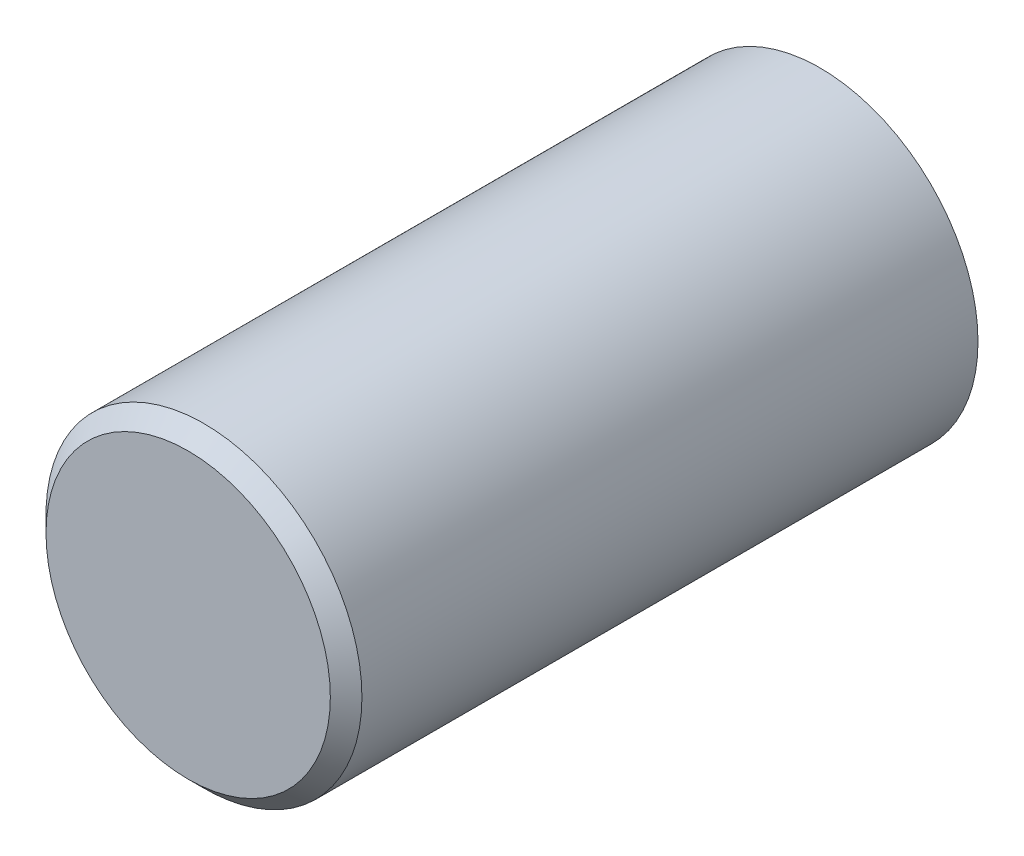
from build123d import *

# Parameters (mm, degrees)
ESQUISSE1_R      = 10
EXTRUSION1_DEPTH = 40
CHANFREIN1_SIZE  = 1


with BuildPart() as part:
    # Esquisse1 → Extrusion1 (new body)
    with BuildSketch(Plane.XY):
        Circle(ESQUISSE1_R)
    extrude(amount=EXTRUSION1_DEPTH)

    # Chanfrein1
    chanfrein1_edges = [part.edges().sort_by_distance(p)[0] for p in [
        (-10, 0, 40),
    ]]
    chamfer(chanfrein1_edges, length=CHANFREIN1_SIZE)


solid = part.part
